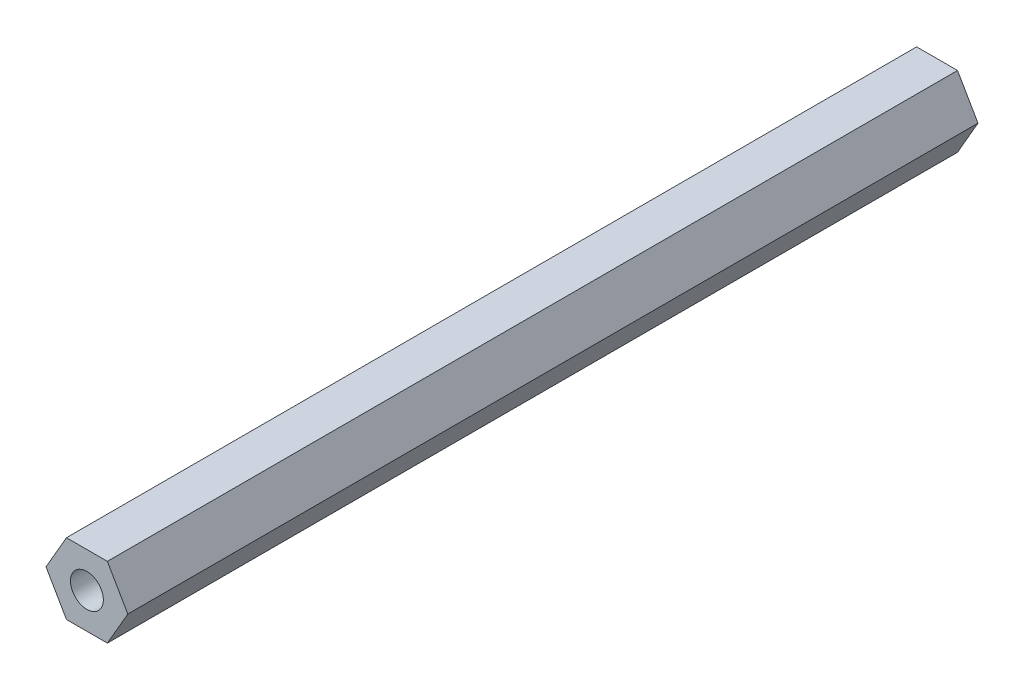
ISO-10303-21;
HEADER;
FILE_DESCRIPTION(('STEP AP214'),'2;1');
FILE_NAME('part.step','',(''),(''),'','','');
FILE_SCHEMA(('AUTOMOTIVE_DESIGN { 1 0 10303 214 1 1 1 1 }'));
ENDSEC;
DATA;
#1=APPLICATION_CONTEXT('core data for automotive mechanical design processes');
#2=APPLICATION_PROTOCOL_DEFINITION('international standard','automotive_design',2000,#1);
#3=PRODUCT_CONTEXT('',#1,'mechanical');
#4=PRODUCT('Part','Part','',(#3));
#5=PRODUCT_RELATED_PRODUCT_CATEGORY('part','',(#4));
#6=PRODUCT_DEFINITION_FORMATION('','',#4);
#7=PRODUCT_DEFINITION_CONTEXT('part definition',#1,'design');
#8=PRODUCT_DEFINITION('design','',#6,#7);
#9=PRODUCT_DEFINITION_SHAPE('','',#8);
#10=(LENGTH_UNIT() NAMED_UNIT(*) SI_UNIT(.MILLI.,.METRE.));
#11=(NAMED_UNIT(*) PLANE_ANGLE_UNIT() SI_UNIT($,.RADIAN.));
#12=(NAMED_UNIT(*) SI_UNIT($,.STERADIAN.) SOLID_ANGLE_UNIT());
#13=UNCERTAINTY_MEASURE_WITH_UNIT(LENGTH_MEASURE(1.E-05),#10,'distance_accuracy_value','');
#14=(GEOMETRIC_REPRESENTATION_CONTEXT(3) GLOBAL_UNCERTAINTY_ASSIGNED_CONTEXT((#13)) GLOBAL_UNIT_ASSIGNED_CONTEXT((#10,
#11,#12)) REPRESENTATION_CONTEXT('',''));
#15=CARTESIAN_POINT('',(0.,0.,0.));
#16=DIRECTION('',(0.,0.,1.));
#17=DIRECTION('',(1.,0.,0.));
#18=AXIS2_PLACEMENT_3D('',#15,#16,#17);
#19=CARTESIAN_POINT('',(3.66617420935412,0.,76.2));
#20=DIRECTION('',(-0.866025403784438,-0.5,0.));
#21=DIRECTION('',(0.5,-0.866025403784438,0.));
#22=AXIS2_PLACEMENT_3D('',#19,#20,#21);
#23=PLANE('',#22);
#24=DIRECTION('',(-0.5,0.866025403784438,0.));
#25=VECTOR('',#24,1.);
#26=CARTESIAN_POINT('',(3.66617420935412,0.,0.));
#27=LINE('',#26,#25);
#28=CARTESIAN_POINT('',(3.66617420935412,0.,0.));
#29=VERTEX_POINT('',#28);
#30=CARTESIAN_POINT('',(1.83308710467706,3.175,0.));
#31=VERTEX_POINT('',#30);
#32=EDGE_CURVE('E121',#29,#31,#27,.T.);
#33=ORIENTED_EDGE('',*,*,#32,.T.);
#34=DIRECTION('',(0.,0.,-1.));
#35=VECTOR('',#34,1.);
#36=CARTESIAN_POINT('',(1.83308710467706,3.175,76.2));
#37=LINE('',#36,#35);
#38=CARTESIAN_POINT('',(1.83308710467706,3.175,76.2));
#39=VERTEX_POINT('',#38);
#40=EDGE_CURVE('E11',#39,#31,#37,.T.);
#41=ORIENTED_EDGE('',*,*,#40,.F.);
#42=DIRECTION('',(-0.5,0.866025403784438,0.));
#43=VECTOR('',#42,1.);
#44=CARTESIAN_POINT('',(3.66617420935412,0.,76.2));
#45=LINE('',#44,#43);
#46=CARTESIAN_POINT('',(3.66617420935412,0.,76.2));
#47=VERTEX_POINT('',#46);
#48=EDGE_CURVE('E132',#47,#39,#45,.T.);
#49=ORIENTED_EDGE('',*,*,#48,.F.);
#50=DIRECTION('',(0.,0.,-1.));
#51=VECTOR('',#50,1.);
#52=CARTESIAN_POINT('',(3.66617420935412,0.,76.2));
#53=LINE('',#52,#51);
#54=EDGE_CURVE('E117',#47,#29,#53,.T.);
#55=ORIENTED_EDGE('',*,*,#54,.T.);
#56=EDGE_LOOP('',(#33,#41,#49,#55));
#57=FACE_BOUND('',#56,.T.);
#58=ADVANCED_FACE('F37',(#57),#23,.F.);
#59=CARTESIAN_POINT('',(1.83308710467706,3.175,76.2));
#60=DIRECTION('',(0.,-1.,0.));
#61=DIRECTION('',(0.,0.,-1.));
#62=AXIS2_PLACEMENT_3D('',#59,#60,#61);
#63=PLANE('',#62);
#64=DIRECTION('',(-1.,0.,0.));
#65=VECTOR('',#64,1.);
#66=CARTESIAN_POINT('',(1.83308710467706,3.175,0.));
#67=LINE('',#66,#65);
#68=CARTESIAN_POINT('',(-1.83308710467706,3.175,0.));
#69=VERTEX_POINT('',#68);
#70=EDGE_CURVE('E124',#31,#69,#67,.T.);
#71=ORIENTED_EDGE('',*,*,#70,.T.);
#72=DIRECTION('',(0.,0.,-1.));
#73=VECTOR('',#72,1.);
#74=CARTESIAN_POINT('',(-1.83308710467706,3.175,76.2));
#75=LINE('',#74,#73);
#76=CARTESIAN_POINT('',(-1.83308710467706,3.175,76.2));
#77=VERTEX_POINT('',#76);
#78=EDGE_CURVE('E45',#77,#69,#75,.T.);
#79=ORIENTED_EDGE('',*,*,#78,.F.);
#80=DIRECTION('',(-1.,0.,0.));
#81=VECTOR('',#80,1.);
#82=CARTESIAN_POINT('',(1.83308710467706,3.175,76.2));
#83=LINE('',#82,#81);
#84=EDGE_CURVE('E90',#39,#77,#83,.T.);
#85=ORIENTED_EDGE('',*,*,#84,.F.);
#86=ORIENTED_EDGE('',*,*,#40,.T.);
#87=EDGE_LOOP('',(#71,#79,#85,#86));
#88=FACE_BOUND('',#87,.T.);
#89=ADVANCED_FACE('F157',(#88),#63,.F.);
#90=CARTESIAN_POINT('',(-1.83308710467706,3.175,76.2));
#91=DIRECTION('',(0.866025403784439,-0.5,0.));
#92=DIRECTION('',(0.5,0.866025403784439,0.));
#93=AXIS2_PLACEMENT_3D('',#90,#91,#92);
#94=PLANE('',#93);
#95=DIRECTION('',(-0.5,-0.866025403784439,0.));
#96=VECTOR('',#95,1.);
#97=CARTESIAN_POINT('',(-1.83308710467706,3.175,0.));
#98=LINE('',#97,#96);
#99=CARTESIAN_POINT('',(-3.66617420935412,0.,0.));
#100=VERTEX_POINT('',#99);
#101=EDGE_CURVE('E127',#69,#100,#98,.T.);
#102=ORIENTED_EDGE('',*,*,#101,.T.);
#103=DIRECTION('',(0.,0.,-1.));
#104=VECTOR('',#103,1.);
#105=CARTESIAN_POINT('',(-3.66617420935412,0.,76.2));
#106=LINE('',#105,#104);
#107=CARTESIAN_POINT('',(-3.66617420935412,0.,76.2));
#108=VERTEX_POINT('',#107);
#109=EDGE_CURVE('E112',#108,#100,#106,.T.);
#110=ORIENTED_EDGE('',*,*,#109,.F.);
#111=DIRECTION('',(-0.5,-0.866025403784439,0.));
#112=VECTOR('',#111,1.);
#113=CARTESIAN_POINT('',(-1.83308710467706,3.175,76.2));
#114=LINE('',#113,#112);
#115=EDGE_CURVE('E103',#77,#108,#114,.T.);
#116=ORIENTED_EDGE('',*,*,#115,.F.);
#117=ORIENTED_EDGE('',*,*,#78,.T.);
#118=EDGE_LOOP('',(#102,#110,#116,#117));
#119=FACE_BOUND('',#118,.T.);
#120=ADVANCED_FACE('F138',(#119),#94,.F.);
#121=CARTESIAN_POINT('',(-3.66617420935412,0.,76.2));
#122=DIRECTION('',(0.866025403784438,0.5,0.));
#123=DIRECTION('',(-0.5,0.866025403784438,0.));
#124=AXIS2_PLACEMENT_3D('',#121,#122,#123);
#125=PLANE('',#124);
#126=DIRECTION('',(0.5,-0.866025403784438,0.));
#127=VECTOR('',#126,1.);
#128=CARTESIAN_POINT('',(-3.66617420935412,0.,0.));
#129=LINE('',#128,#127);
#130=CARTESIAN_POINT('',(-1.83308710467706,-3.175,0.));
#131=VERTEX_POINT('',#130);
#132=EDGE_CURVE('E111',#100,#131,#129,.T.);
#133=ORIENTED_EDGE('',*,*,#132,.T.);
#134=DIRECTION('',(0.,0.,-1.));
#135=VECTOR('',#134,1.);
#136=CARTESIAN_POINT('',(-1.83308710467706,-3.175,76.2));
#137=LINE('',#136,#135);
#138=CARTESIAN_POINT('',(-1.83308710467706,-3.175,76.2));
#139=VERTEX_POINT('',#138);
#140=EDGE_CURVE('E108',#139,#131,#137,.T.);
#141=ORIENTED_EDGE('',*,*,#140,.F.);
#142=DIRECTION('',(0.5,-0.866025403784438,0.));
#143=VECTOR('',#142,1.);
#144=CARTESIAN_POINT('',(-3.66617420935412,0.,76.2));
#145=LINE('',#144,#143);
#146=EDGE_CURVE('E97',#108,#139,#145,.T.);
#147=ORIENTED_EDGE('',*,*,#146,.F.);
#148=ORIENTED_EDGE('',*,*,#109,.T.);
#149=EDGE_LOOP('',(#133,#141,#147,#148));
#150=FACE_BOUND('',#149,.T.);
#151=ADVANCED_FACE('F109',(#150),#125,.F.);
#152=CARTESIAN_POINT('',(-1.83308710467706,-3.175,76.2));
#153=DIRECTION('',(0.,1.,0.));
#154=DIRECTION('',(-1.,0.,0.));
#155=AXIS2_PLACEMENT_3D('',#152,#153,#154);
#156=PLANE('',#155);
#157=DIRECTION('',(1.,0.,0.));
#158=VECTOR('',#157,1.);
#159=CARTESIAN_POINT('',(-1.83308710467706,-3.175,0.));
#160=LINE('',#159,#158);
#161=CARTESIAN_POINT('',(1.83308710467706,-3.175,0.));
#162=VERTEX_POINT('',#161);
#163=EDGE_CURVE('E76',#131,#162,#160,.T.);
#164=ORIENTED_EDGE('',*,*,#163,.T.);
#165=DIRECTION('',(0.,0.,-1.));
#166=VECTOR('',#165,1.);
#167=CARTESIAN_POINT('',(1.83308710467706,-3.175,76.2));
#168=LINE('',#167,#166);
#169=CARTESIAN_POINT('',(1.83308710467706,-3.175,76.2));
#170=VERTEX_POINT('',#169);
#171=EDGE_CURVE('E113',#170,#162,#168,.T.);
#172=ORIENTED_EDGE('',*,*,#171,.F.);
#173=DIRECTION('',(1.,0.,0.));
#174=VECTOR('',#173,1.);
#175=CARTESIAN_POINT('',(-1.83308710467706,-3.175,76.2));
#176=LINE('',#175,#174);
#177=EDGE_CURVE('E101',#139,#170,#176,.T.);
#178=ORIENTED_EDGE('',*,*,#177,.F.);
#179=ORIENTED_EDGE('',*,*,#140,.T.);
#180=EDGE_LOOP('',(#164,#172,#178,#179));
#181=FACE_BOUND('',#180,.T.);
#182=ADVANCED_FACE('F115',(#181),#156,.F.);
#183=CARTESIAN_POINT('',(1.83308710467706,-3.175,76.2));
#184=DIRECTION('',(-0.866025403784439,0.5,0.));
#185=DIRECTION('',(-0.5,-0.866025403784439,0.));
#186=AXIS2_PLACEMENT_3D('',#183,#184,#185);
#187=PLANE('',#186);
#188=DIRECTION('',(0.5,0.866025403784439,0.));
#189=VECTOR('',#188,1.);
#190=CARTESIAN_POINT('',(1.83308710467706,-3.175,0.));
#191=LINE('',#190,#189);
#192=EDGE_CURVE('E82',#162,#29,#191,.T.);
#193=ORIENTED_EDGE('',*,*,#192,.T.);
#194=ORIENTED_EDGE('',*,*,#54,.F.);
#195=DIRECTION('',(0.5,0.866025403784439,0.));
#196=VECTOR('',#195,1.);
#197=CARTESIAN_POINT('',(1.83308710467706,-3.175,76.2));
#198=LINE('',#197,#196);
#199=EDGE_CURVE('E53',#170,#47,#198,.T.);
#200=ORIENTED_EDGE('',*,*,#199,.F.);
#201=ORIENTED_EDGE('',*,*,#171,.T.);
#202=EDGE_LOOP('',(#193,#194,#200,#201));
#203=FACE_BOUND('',#202,.T.);
#204=ADVANCED_FACE('F145',(#203),#187,.F.);
#205=CARTESIAN_POINT('',(0.,0.,76.2));
#206=DIRECTION('',(0.,0.,1.));
#207=DIRECTION('',(1.,0.,0.));
#208=AXIS2_PLACEMENT_3D('',#205,#206,#207);
#209=PLANE('',#208);
#210=CARTESIAN_POINT('',(0.,0.,76.2));
#211=DIRECTION('',(0.,0.,1.));
#212=DIRECTION('',(1.,0.,0.));
#213=AXIS2_PLACEMENT_3D('',#210,#211,#212);
#214=CIRCLE('',#213,1.47319999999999);
#215=CARTESIAN_POINT('',(1.47319999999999,0.,76.2));
#216=VERTEX_POINT('',#215);
#217=EDGE_CURVE('E212',#216,#216,#214,.T.);
#218=ORIENTED_EDGE('',*,*,#217,.F.);
#219=EDGE_LOOP('',(#218));
#220=FACE_BOUND('',#219,.T.);
#221=ORIENTED_EDGE('',*,*,#48,.T.);
#222=ORIENTED_EDGE('',*,*,#84,.T.);
#223=ORIENTED_EDGE('',*,*,#115,.T.);
#224=ORIENTED_EDGE('',*,*,#146,.T.);
#225=ORIENTED_EDGE('',*,*,#177,.T.);
#226=ORIENTED_EDGE('',*,*,#199,.T.);
#227=EDGE_LOOP('',(#221,#222,#223,#224,#225,#226));
#228=FACE_BOUND('',#227,.T.);
#229=ADVANCED_FACE('F99',(#220,#228),#209,.T.);
#230=CARTESIAN_POINT('',(0.,0.,0.));
#231=DIRECTION('',(0.,0.,1.));
#232=DIRECTION('',(1.,0.,0.));
#233=AXIS2_PLACEMENT_3D('',#230,#231,#232);
#234=PLANE('',#233);
#235=CARTESIAN_POINT('',(0.,0.,0.));
#236=DIRECTION('',(0.,0.,1.));
#237=DIRECTION('',(1.,0.,0.));
#238=AXIS2_PLACEMENT_3D('',#235,#236,#237);
#239=CIRCLE('',#238,1.47319999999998);
#240=CARTESIAN_POINT('',(1.47319999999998,0.,0.));
#241=VERTEX_POINT('',#240);
#242=EDGE_CURVE('E125',#241,#241,#239,.T.);
#243=ORIENTED_EDGE('',*,*,#242,.T.);
#244=EDGE_LOOP('',(#243));
#245=FACE_BOUND('',#244,.T.);
#246=ORIENTED_EDGE('',*,*,#32,.F.);
#247=ORIENTED_EDGE('',*,*,#192,.F.);
#248=ORIENTED_EDGE('',*,*,#163,.F.);
#249=ORIENTED_EDGE('',*,*,#132,.F.);
#250=ORIENTED_EDGE('',*,*,#101,.F.);
#251=ORIENTED_EDGE('',*,*,#70,.F.);
#252=EDGE_LOOP('',(#246,#247,#248,#249,#250,#251));
#253=FACE_BOUND('',#252,.T.);
#254=ADVANCED_FACE('F141',(#245,#253),#234,.F.);
#255=CARTESIAN_POINT('',(0.,0.,76.2));
#256=DIRECTION('',(0.,0.,1.));
#257=DIRECTION('',(1.,0.,0.));
#258=AXIS2_PLACEMENT_3D('',#255,#256,#257);
#259=CYLINDRICAL_SURFACE('',#258,1.47319999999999);
#260=ORIENTED_EDGE('',*,*,#242,.F.);
#261=EDGE_LOOP('',(#260));
#262=FACE_BOUND('',#261,.T.);
#263=ORIENTED_EDGE('',*,*,#217,.T.);
#264=EDGE_LOOP('',(#263));
#265=FACE_BOUND('',#264,.T.);
#266=ADVANCED_FACE('F194',(#262,#265),#259,.F.);
#267=CLOSED_SHELL('',(#58,#89,#120,#151,#182,#204,#229,#254,#266));
#268=MANIFOLD_SOLID_BREP('B2',#267);
#269=ADVANCED_BREP_SHAPE_REPRESENTATION('',(#18,#268),#14);
#270=SHAPE_DEFINITION_REPRESENTATION(#9,#269);
ENDSEC;
END-ISO-10303-21;
